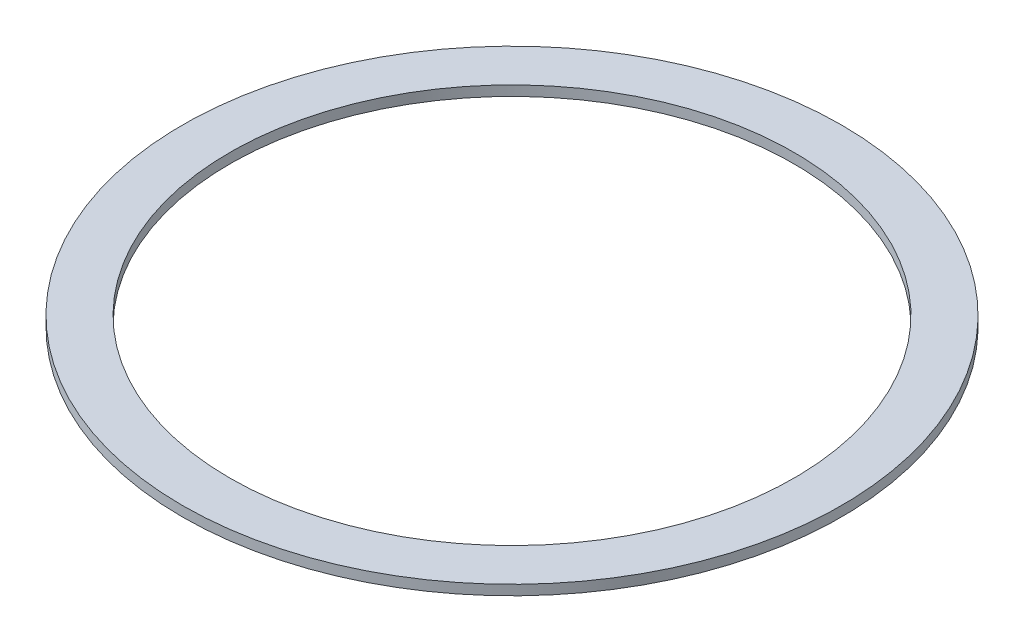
from build123d import *

# Parameters (mm, degrees)
ESQUISSE1_R      = 66
ESQUISSE1_R_2    = 56.5
EXTRUSION1_DEPTH = 2


with BuildPart() as part:
    # Esquisse1 → Extrusion1 (new body)
    with BuildSketch(Plane(origin=(0, 0, 0), x_dir=(1, 0, 0), z_dir=(0, 1, 0))):
        with Locations(Location((0, 0, 0), (0, 0, 270))):
            Circle(ESQUISSE1_R)
        with Locations(Location((0, 0, 0), (0, 0, 270))):
            Circle(ESQUISSE1_R_2, mode=Mode.SUBTRACT)
    extrude(amount=EXTRUSION1_DEPTH)


solid = part.part
